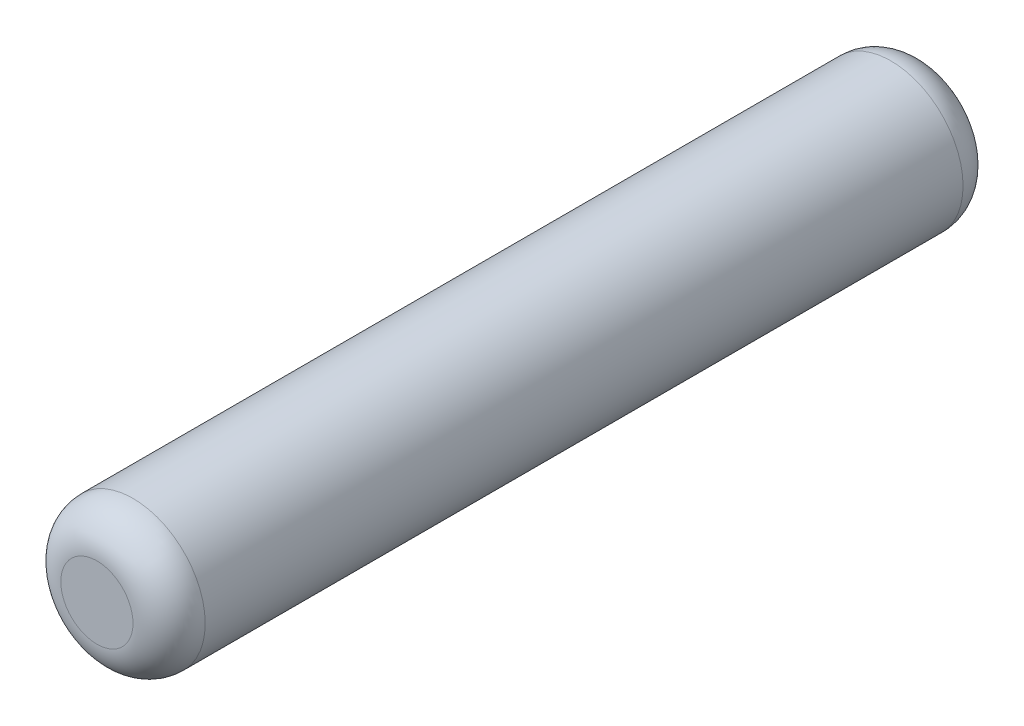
ISO-10303-21;
HEADER;
FILE_DESCRIPTION(('STEP AP214'),'2;1');
FILE_NAME('part.step','',(''),(''),'','','');
FILE_SCHEMA(('AUTOMOTIVE_DESIGN { 1 0 10303 214 1 1 1 1 }'));
ENDSEC;
DATA;
#1=APPLICATION_CONTEXT('core data for automotive mechanical design processes');
#2=APPLICATION_PROTOCOL_DEFINITION('international standard','automotive_design',2000,#1);
#3=PRODUCT_CONTEXT('',#1,'mechanical');
#4=PRODUCT('Part','Part','',(#3));
#5=PRODUCT_RELATED_PRODUCT_CATEGORY('part','',(#4));
#6=PRODUCT_DEFINITION_FORMATION('','',#4);
#7=PRODUCT_DEFINITION_CONTEXT('part definition',#1,'design');
#8=PRODUCT_DEFINITION('design','',#6,#7);
#9=PRODUCT_DEFINITION_SHAPE('','',#8);
#10=(LENGTH_UNIT() NAMED_UNIT(*) SI_UNIT(.MILLI.,.METRE.));
#11=(NAMED_UNIT(*) PLANE_ANGLE_UNIT() SI_UNIT($,.RADIAN.));
#12=(NAMED_UNIT(*) SI_UNIT($,.STERADIAN.) SOLID_ANGLE_UNIT());
#13=UNCERTAINTY_MEASURE_WITH_UNIT(LENGTH_MEASURE(1.E-05),#10,'distance_accuracy_value','');
#14=(GEOMETRIC_REPRESENTATION_CONTEXT(3) GLOBAL_UNCERTAINTY_ASSIGNED_CONTEXT((#13)) GLOBAL_UNIT_ASSIGNED_CONTEXT((#10,
#11,#12)) REPRESENTATION_CONTEXT('',''));
#15=CARTESIAN_POINT('',(0.,0.,0.));
#16=DIRECTION('',(0.,0.,1.));
#17=DIRECTION('',(1.,0.,0.));
#18=AXIS2_PLACEMENT_3D('',#15,#16,#17);
#19=CARTESIAN_POINT('',(0.,0.,5.75));
#20=DIRECTION('',(0.,0.,-1.));
#21=DIRECTION('',(-1.,0.,0.));
#22=AXIS2_PLACEMENT_3D('',#19,#20,#21);
#23=CYLINDRICAL_SURFACE('',#22,1.);
#24=CARTESIAN_POINT('',(0.,0.,5.25));
#25=DIRECTION('',(0.,0.,1.));
#26=DIRECTION('',(1.,0.,0.));
#27=AXIS2_PLACEMENT_3D('',#24,#25,#26);
#28=CIRCLE('',#27,1.);
#29=CARTESIAN_POINT('',(1.,0.,5.25));
#30=VERTEX_POINT('',#29);
#31=EDGE_CURVE('E32',#30,#30,#28,.F.);
#32=ORIENTED_EDGE('',*,*,#31,.T.);
#33=EDGE_LOOP('',(#32));
#34=FACE_BOUND('',#33,.T.);
#35=CARTESIAN_POINT('',(0.,0.,-5.25));
#36=DIRECTION('',(0.,0.,1.));
#37=DIRECTION('',(1.,0.,0.));
#38=AXIS2_PLACEMENT_3D('',#35,#36,#37);
#39=CIRCLE('',#38,1.);
#40=CARTESIAN_POINT('',(1.,0.,-5.25));
#41=VERTEX_POINT('',#40);
#42=EDGE_CURVE('E36',#41,#41,#39,.T.);
#43=ORIENTED_EDGE('',*,*,#42,.T.);
#44=EDGE_LOOP('',(#43));
#45=FACE_BOUND('',#44,.T.);
#46=ADVANCED_FACE('F26',(#34,#45),#23,.T.);
#47=CARTESIAN_POINT('',(0.,0.,5.75));
#48=DIRECTION('',(0.,0.,1.));
#49=DIRECTION('',(1.,0.,0.));
#50=AXIS2_PLACEMENT_3D('',#47,#48,#49);
#51=PLANE('',#50);
#52=CARTESIAN_POINT('',(0.,0.,5.75));
#53=DIRECTION('',(0.,0.,1.));
#54=DIRECTION('',(1.,0.,0.));
#55=AXIS2_PLACEMENT_3D('',#52,#53,#54);
#56=CIRCLE('',#55,0.500000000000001);
#57=CARTESIAN_POINT('',(0.500000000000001,0.,5.75));
#58=VERTEX_POINT('',#57);
#59=EDGE_CURVE('E40',#58,#58,#56,.T.);
#60=ORIENTED_EDGE('',*,*,#59,.T.);
#61=EDGE_LOOP('',(#60));
#62=FACE_BOUND('',#61,.T.);
#63=ADVANCED_FACE('F46',(#62),#51,.T.);
#64=CARTESIAN_POINT('',(0.,0.,-5.75));
#65=DIRECTION('',(0.,0.,1.));
#66=DIRECTION('',(1.,0.,0.));
#67=AXIS2_PLACEMENT_3D('',#64,#65,#66);
#68=PLANE('',#67);
#69=CARTESIAN_POINT('',(0.,0.,-5.75));
#70=DIRECTION('',(0.,0.,1.));
#71=DIRECTION('',(1.,0.,0.));
#72=AXIS2_PLACEMENT_3D('',#69,#70,#71);
#73=CIRCLE('',#72,0.500000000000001);
#74=CARTESIAN_POINT('',(0.500000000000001,0.,-5.75));
#75=VERTEX_POINT('',#74);
#76=EDGE_CURVE('E10',#75,#75,#73,.F.);
#77=ORIENTED_EDGE('',*,*,#76,.T.);
#78=EDGE_LOOP('',(#77));
#79=FACE_BOUND('',#78,.T.);
#80=ADVANCED_FACE('F51',(#79),#68,.F.);
#81=CARTESIAN_POINT('',(0.,0.,5.25));
#82=DIRECTION('',(0.,0.,1.));
#83=DIRECTION('',(1.,0.,0.));
#84=AXIS2_PLACEMENT_3D('',#81,#82,#83);
#85=TOROIDAL_SURFACE('',#84,0.500000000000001,0.5);
#86=ORIENTED_EDGE('',*,*,#31,.F.);
#87=EDGE_LOOP('',(#86));
#88=FACE_BOUND('',#87,.T.);
#89=ORIENTED_EDGE('',*,*,#59,.F.);
#90=EDGE_LOOP('',(#89));
#91=FACE_BOUND('',#90,.T.);
#92=ADVANCED_FACE('F48',(#88,#91),#85,.T.);
#93=CARTESIAN_POINT('',(0.,0.,-5.25));
#94=DIRECTION('',(0.,0.,1.));
#95=DIRECTION('',(1.,0.,0.));
#96=AXIS2_PLACEMENT_3D('',#93,#94,#95);
#97=TOROIDAL_SURFACE('',#96,0.500000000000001,0.5);
#98=ORIENTED_EDGE('',*,*,#76,.F.);
#99=EDGE_LOOP('',(#98));
#100=FACE_BOUND('',#99,.T.);
#101=ORIENTED_EDGE('',*,*,#42,.F.);
#102=EDGE_LOOP('',(#101));
#103=FACE_BOUND('',#102,.T.);
#104=ADVANCED_FACE('F50',(#100,#103),#97,.T.);
#105=CLOSED_SHELL('',(#46,#63,#80,#92,#104));
#106=MANIFOLD_SOLID_BREP('B2',#105);
#107=ADVANCED_BREP_SHAPE_REPRESENTATION('',(#18,#106),#14);
#108=SHAPE_DEFINITION_REPRESENTATION(#9,#107);
ENDSEC;
END-ISO-10303-21;
